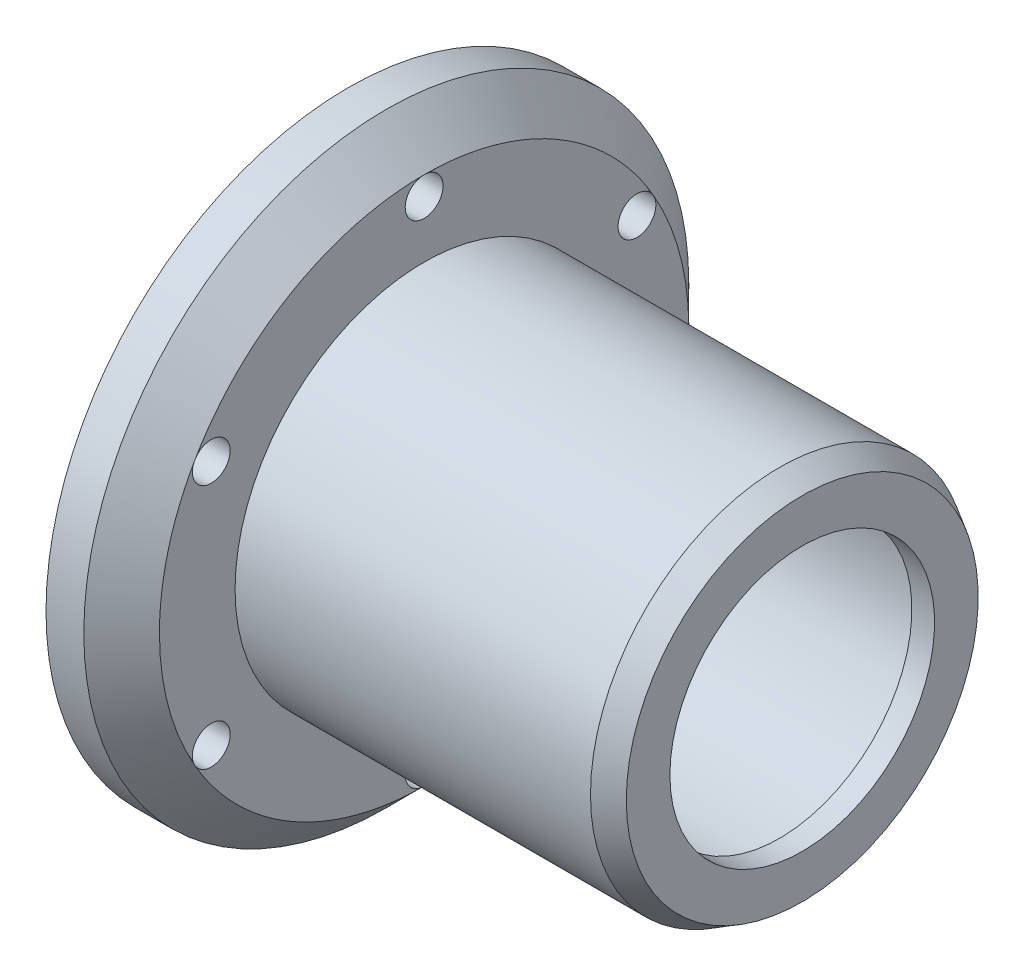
from build123d import *

# Parameters (mm, degrees)
TROU_TARAUD_M61_D            = 5
R_P_TITION_CIRCULAIRE1_COUNT = 6


with BuildPart() as part:
    # Esquisse1 → R_volution1 (revolve)
    with BuildSketch(Plane.XY, mode=Mode.PRIVATE) as r_volution1_sk:
        Polygon((1.487947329, 21), (57.487947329, 21), (57.487947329, 17.5), (60.487947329, 17.5), (60.487947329, 23.267949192), (57.487947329, 25), (10.487947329, 25), (10.487947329, 35), (5.487947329, 40), (0.487947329, 40), (0.487947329, 26.6), (2.087947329, 26.6), (2.087947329, 23), (0.487947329, 23), (0.487947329, 21.577350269), align=None)
    revolve(r_volution1_sk.sketch.rotate(Axis((0, 0, 0), (1, 0, 0)), 90), axis=Axis((0, 0, 0), (1, 0, 0)))

    # Trou taraud_ M61 (through all)
    with Locations(Plane.ZY.offset(-0.487947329)):
        with Locations((0, 32.5)):
            trou_taraud_m61 = Hole(TROU_TARAUD_M61_D / 2)

    # R_p_tition circulaire1: Trou taraud_ M61 ×6 about axis
    r_p_tition_circulaire1_axis = Axis((0, 0, 0), (1, 0, 0))
    for i in range(1, R_P_TITION_CIRCULAIRE1_COUNT):
        add(trou_taraud_m61.rotate(r_p_tition_circulaire1_axis, i * 360 / R_P_TITION_CIRCULAIRE1_COUNT), mode=Mode.SUBTRACT)


solid = part.part
